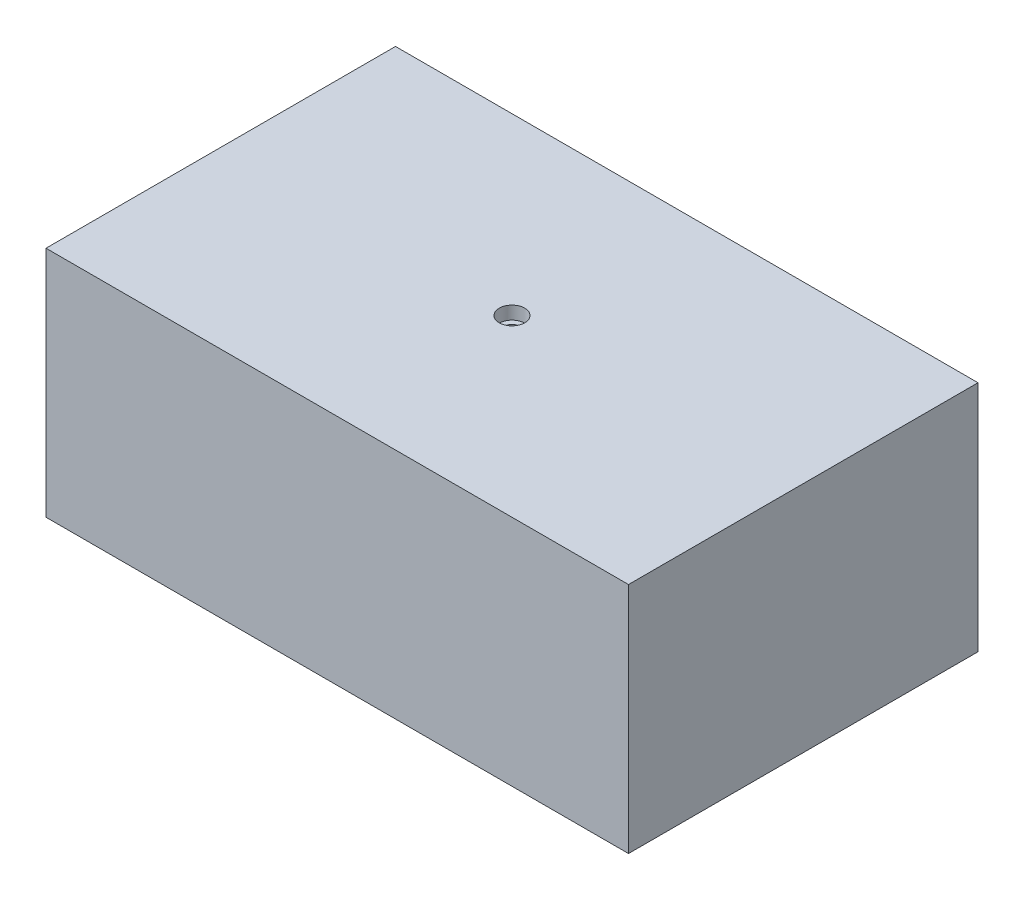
ISO-10303-21;
HEADER;
FILE_DESCRIPTION(('STEP AP214'),'2;1');
FILE_NAME('part.step','',(''),(''),'','','');
FILE_SCHEMA(('AUTOMOTIVE_DESIGN { 1 0 10303 214 1 1 1 1 }'));
ENDSEC;
DATA;
#1=APPLICATION_CONTEXT('core data for automotive mechanical design processes');
#2=APPLICATION_PROTOCOL_DEFINITION('international standard','automotive_design',2000,#1);
#3=PRODUCT_CONTEXT('',#1,'mechanical');
#4=PRODUCT('Part','Part','',(#3));
#5=PRODUCT_RELATED_PRODUCT_CATEGORY('part','',(#4));
#6=PRODUCT_DEFINITION_FORMATION('','',#4);
#7=PRODUCT_DEFINITION_CONTEXT('part definition',#1,'design');
#8=PRODUCT_DEFINITION('design','',#6,#7);
#9=PRODUCT_DEFINITION_SHAPE('','',#8);
#10=(LENGTH_UNIT() NAMED_UNIT(*) SI_UNIT(.MILLI.,.METRE.));
#11=(NAMED_UNIT(*) PLANE_ANGLE_UNIT() SI_UNIT($,.RADIAN.));
#12=(NAMED_UNIT(*) SI_UNIT($,.STERADIAN.) SOLID_ANGLE_UNIT());
#13=UNCERTAINTY_MEASURE_WITH_UNIT(LENGTH_MEASURE(1.E-05),#10,'distance_accuracy_value','');
#14=(GEOMETRIC_REPRESENTATION_CONTEXT(3) GLOBAL_UNCERTAINTY_ASSIGNED_CONTEXT((#13)) GLOBAL_UNIT_ASSIGNED_CONTEXT((#10,
#11,#12)) REPRESENTATION_CONTEXT('',''));
#15=CARTESIAN_POINT('',(0.,0.,0.));
#16=DIRECTION('',(0.,0.,1.));
#17=DIRECTION('',(1.,0.,0.));
#18=AXIS2_PLACEMENT_3D('',#15,#16,#17);
#19=CARTESIAN_POINT('',(63.5000000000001,50.8,38.1000000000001));
#20=DIRECTION('',(-1.,0.,0.));
#21=DIRECTION('',(0.,0.,1.));
#22=AXIS2_PLACEMENT_3D('',#19,#20,#21);
#23=PLANE('',#22);
#24=DIRECTION('',(0.,0.,-1.));
#25=VECTOR('',#24,1.);
#26=CARTESIAN_POINT('',(63.5000000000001,0.,38.1000000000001));
#27=LINE('',#26,#25);
#28=CARTESIAN_POINT('',(63.5000000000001,0.,38.1000000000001));
#29=VERTEX_POINT('',#28);
#30=CARTESIAN_POINT('',(63.5000000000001,0.,-38.0999999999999));
#31=VERTEX_POINT('',#30);
#32=EDGE_CURVE('E100',#29,#31,#27,.T.);
#33=ORIENTED_EDGE('',*,*,#32,.T.);
#34=DIRECTION('',(0.,-1.,0.));
#35=VECTOR('',#34,1.);
#36=CARTESIAN_POINT('',(63.5000000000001,50.8,-38.0999999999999));
#37=LINE('',#36,#35);
#38=CARTESIAN_POINT('',(63.5000000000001,50.8,-38.0999999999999));
#39=VERTEX_POINT('',#38);
#40=EDGE_CURVE('E11',#39,#31,#37,.T.);
#41=ORIENTED_EDGE('',*,*,#40,.F.);
#42=DIRECTION('',(0.,0.,-1.));
#43=VECTOR('',#42,1.);
#44=CARTESIAN_POINT('',(63.5000000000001,50.8,38.1000000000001));
#45=LINE('',#44,#43);
#46=CARTESIAN_POINT('',(63.5000000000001,50.8,38.1000000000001));
#47=VERTEX_POINT('',#46);
#48=EDGE_CURVE('E88',#47,#39,#45,.T.);
#49=ORIENTED_EDGE('',*,*,#48,.F.);
#50=DIRECTION('',(0.,-1.,0.));
#51=VECTOR('',#50,1.);
#52=CARTESIAN_POINT('',(63.5000000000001,50.8,38.1000000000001));
#53=LINE('',#52,#51);
#54=EDGE_CURVE('E96',#47,#29,#53,.T.);
#55=ORIENTED_EDGE('',*,*,#54,.T.);
#56=EDGE_LOOP('',(#33,#41,#49,#55));
#57=FACE_BOUND('',#56,.T.);
#58=ADVANCED_FACE('F37',(#57),#23,.F.);
#59=CARTESIAN_POINT('',(-63.4999999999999,50.8,-38.0999999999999));
#60=DIRECTION('',(0.,0.,1.));
#61=DIRECTION('',(1.,0.,0.));
#62=AXIS2_PLACEMENT_3D('',#59,#60,#61);
#63=PLANE('',#62);
#64=DIRECTION('',(-1.,0.,0.));
#65=VECTOR('',#64,1.);
#66=CARTESIAN_POINT('',(-63.4999999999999,0.,-38.0999999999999));
#67=LINE('',#66,#65);
#68=CARTESIAN_POINT('',(-63.4999999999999,0.,-38.0999999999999));
#69=VERTEX_POINT('',#68);
#70=EDGE_CURVE('E92',#31,#69,#67,.T.);
#71=ORIENTED_EDGE('',*,*,#70,.T.);
#72=DIRECTION('',(0.,-1.,0.));
#73=VECTOR('',#72,1.);
#74=CARTESIAN_POINT('',(-63.4999999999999,50.8,-38.0999999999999));
#75=LINE('',#74,#73);
#76=CARTESIAN_POINT('',(-63.4999999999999,50.8,-38.0999999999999));
#77=VERTEX_POINT('',#76);
#78=EDGE_CURVE('E45',#77,#69,#75,.T.);
#79=ORIENTED_EDGE('',*,*,#78,.F.);
#80=DIRECTION('',(-1.,0.,0.));
#81=VECTOR('',#80,1.);
#82=CARTESIAN_POINT('',(-63.4999999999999,50.8,-38.0999999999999));
#83=LINE('',#82,#81);
#84=EDGE_CURVE('E83',#39,#77,#83,.T.);
#85=ORIENTED_EDGE('',*,*,#84,.F.);
#86=ORIENTED_EDGE('',*,*,#40,.T.);
#87=EDGE_LOOP('',(#71,#79,#85,#86));
#88=FACE_BOUND('',#87,.T.);
#89=ADVANCED_FACE('F91',(#88),#63,.F.);
#90=CARTESIAN_POINT('',(-63.4999999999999,50.8,38.1000000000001));
#91=DIRECTION('',(1.,0.,0.));
#92=DIRECTION('',(0.,0.,-1.));
#93=AXIS2_PLACEMENT_3D('',#90,#91,#92);
#94=PLANE('',#93);
#95=DIRECTION('',(0.,0.,1.));
#96=VECTOR('',#95,1.);
#97=CARTESIAN_POINT('',(-63.4999999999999,0.,38.1000000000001));
#98=LINE('',#97,#96);
#99=CARTESIAN_POINT('',(-63.4999999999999,0.,38.1000000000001));
#100=VERTEX_POINT('',#99);
#101=EDGE_CURVE('E70',#69,#100,#98,.T.);
#102=ORIENTED_EDGE('',*,*,#101,.T.);
#103=DIRECTION('',(0.,-1.,0.));
#104=VECTOR('',#103,1.);
#105=CARTESIAN_POINT('',(-63.4999999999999,50.8,38.1000000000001));
#106=LINE('',#105,#104);
#107=CARTESIAN_POINT('',(-63.4999999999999,50.8,38.1000000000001));
#108=VERTEX_POINT('',#107);
#109=EDGE_CURVE('E93',#108,#100,#106,.T.);
#110=ORIENTED_EDGE('',*,*,#109,.F.);
#111=DIRECTION('',(0.,0.,1.));
#112=VECTOR('',#111,1.);
#113=CARTESIAN_POINT('',(-63.4999999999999,50.8,38.1000000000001));
#114=LINE('',#113,#112);
#115=EDGE_CURVE('E86',#77,#108,#114,.T.);
#116=ORIENTED_EDGE('',*,*,#115,.F.);
#117=ORIENTED_EDGE('',*,*,#78,.T.);
#118=EDGE_LOOP('',(#102,#110,#116,#117));
#119=FACE_BOUND('',#118,.T.);
#120=ADVANCED_FACE('F94',(#119),#94,.F.);
#121=CARTESIAN_POINT('',(-63.4999999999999,50.8,38.1000000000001));
#122=DIRECTION('',(0.,0.,-1.));
#123=DIRECTION('',(-1.,0.,0.));
#124=AXIS2_PLACEMENT_3D('',#121,#122,#123);
#125=PLANE('',#124);
#126=DIRECTION('',(1.,0.,0.));
#127=VECTOR('',#126,1.);
#128=CARTESIAN_POINT('',(-63.4999999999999,0.,38.1000000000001));
#129=LINE('',#128,#127);
#130=EDGE_CURVE('E76',#100,#29,#129,.T.);
#131=ORIENTED_EDGE('',*,*,#130,.T.);
#132=ORIENTED_EDGE('',*,*,#54,.F.);
#133=DIRECTION('',(1.,0.,0.));
#134=VECTOR('',#133,1.);
#135=CARTESIAN_POINT('',(-63.4999999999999,50.8,38.1000000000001));
#136=LINE('',#135,#134);
#137=EDGE_CURVE('E53',#108,#47,#136,.T.);
#138=ORIENTED_EDGE('',*,*,#137,.F.);
#139=ORIENTED_EDGE('',*,*,#109,.T.);
#140=EDGE_LOOP('',(#131,#132,#138,#139));
#141=FACE_BOUND('',#140,.T.);
#142=ADVANCED_FACE('F108',(#141),#125,.F.);
#143=CARTESIAN_POINT('',(0.,50.8,0.));
#144=DIRECTION('',(0.,-1.,0.));
#145=DIRECTION('',(0.,0.,-1.));
#146=AXIS2_PLACEMENT_3D('',#143,#144,#145);
#147=PLANE('',#146);
#148=CARTESIAN_POINT('',(0.,50.8,0.));
#149=DIRECTION('',(0.,1.,0.));
#150=DIRECTION('',(0.,0.,1.));
#151=AXIS2_PLACEMENT_3D('',#148,#149,#150);
#152=CIRCLE('',#151,2.77876);
#153=CARTESIAN_POINT('',(0.,50.8,2.77876));
#154=VERTEX_POINT('',#153);
#155=EDGE_CURVE('E122',#154,#154,#152,.T.);
#156=ORIENTED_EDGE('',*,*,#155,.F.);
#157=EDGE_LOOP('',(#156));
#158=FACE_BOUND('',#157,.T.);
#159=ORIENTED_EDGE('',*,*,#48,.T.);
#160=ORIENTED_EDGE('',*,*,#84,.T.);
#161=ORIENTED_EDGE('',*,*,#115,.T.);
#162=ORIENTED_EDGE('',*,*,#137,.T.);
#163=EDGE_LOOP('',(#159,#160,#161,#162));
#164=FACE_BOUND('',#163,.T.);
#165=ADVANCED_FACE('F84',(#158,#164),#147,.F.);
#166=CARTESIAN_POINT('',(0.,0.,0.));
#167=DIRECTION('',(0.,-1.,0.));
#168=DIRECTION('',(0.,0.,-1.));
#169=AXIS2_PLACEMENT_3D('',#166,#167,#168);
#170=PLANE('',#169);
#171=CARTESIAN_POINT('',(0.,0.,0.));
#172=DIRECTION('',(0.,1.,0.));
#173=DIRECTION('',(0.,0.,1.));
#174=AXIS2_PLACEMENT_3D('',#171,#172,#173);
#175=CIRCLE('',#174,1.63194999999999);
#176=CARTESIAN_POINT('',(0.,0.,1.63194999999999));
#177=VERTEX_POINT('',#176);
#178=EDGE_CURVE('E103',#177,#177,#175,.T.);
#179=ORIENTED_EDGE('',*,*,#178,.T.);
#180=EDGE_LOOP('',(#179));
#181=FACE_BOUND('',#180,.T.);
#182=ORIENTED_EDGE('',*,*,#32,.F.);
#183=ORIENTED_EDGE('',*,*,#130,.F.);
#184=ORIENTED_EDGE('',*,*,#101,.F.);
#185=ORIENTED_EDGE('',*,*,#70,.F.);
#186=EDGE_LOOP('',(#182,#183,#184,#185));
#187=FACE_BOUND('',#186,.T.);
#188=ADVANCED_FACE('F111',(#181,#187),#170,.T.);
#189=CARTESIAN_POINT('',(0.,50.8,0.));
#190=DIRECTION('',(0.,1.,0.));
#191=DIRECTION('',(0.,0.,1.));
#192=AXIS2_PLACEMENT_3D('',#189,#190,#191);
#193=CYLINDRICAL_SURFACE('',#192,1.63195);
#194=ORIENTED_EDGE('',*,*,#178,.F.);
#195=EDGE_LOOP('',(#194));
#196=FACE_BOUND('',#195,.T.);
#197=CARTESIAN_POINT('',(0.,47.9552,0.));
#198=DIRECTION('',(0.,1.,0.));
#199=DIRECTION('',(0.,0.,1.));
#200=AXIS2_PLACEMENT_3D('',#197,#198,#199);
#201=CIRCLE('',#200,1.63195000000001);
#202=CARTESIAN_POINT('',(0.,47.9552,1.63195000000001));
#203=VERTEX_POINT('',#202);
#204=EDGE_CURVE('E116',#203,#203,#201,.T.);
#205=ORIENTED_EDGE('',*,*,#204,.T.);
#206=EDGE_LOOP('',(#205));
#207=FACE_BOUND('',#206,.T.);
#208=ADVANCED_FACE('F134',(#196,#207),#193,.F.);
#209=CARTESIAN_POINT('',(1.63195000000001,47.9552,0.));
#210=DIRECTION('',(0.,-1.,0.));
#211=DIRECTION('',(0.,0.,-1.));
#212=AXIS2_PLACEMENT_3D('',#209,#210,#211);
#213=PLANE('',#212);
#214=ORIENTED_EDGE('',*,*,#204,.F.);
#215=EDGE_LOOP('',(#214));
#216=FACE_BOUND('',#215,.T.);
#217=CARTESIAN_POINT('',(0.,47.9552,0.));
#218=DIRECTION('',(0.,1.,0.));
#219=DIRECTION('',(0.,0.,1.));
#220=AXIS2_PLACEMENT_3D('',#217,#218,#219);
#221=CIRCLE('',#220,2.77876);
#222=CARTESIAN_POINT('',(0.,47.9552,2.77876));
#223=VERTEX_POINT('',#222);
#224=EDGE_CURVE('E119',#223,#223,#221,.T.);
#225=ORIENTED_EDGE('',*,*,#224,.T.);
#226=EDGE_LOOP('',(#225));
#227=FACE_BOUND('',#226,.T.);
#228=ADVANCED_FACE('F175',(#216,#227),#213,.F.);
#229=CARTESIAN_POINT('',(0.,50.8,0.));
#230=DIRECTION('',(0.,1.,0.));
#231=DIRECTION('',(0.,0.,1.));
#232=AXIS2_PLACEMENT_3D('',#229,#230,#231);
#233=CYLINDRICAL_SURFACE('',#232,2.77876);
#234=ORIENTED_EDGE('',*,*,#224,.F.);
#235=EDGE_LOOP('',(#234));
#236=FACE_BOUND('',#235,.T.);
#237=ORIENTED_EDGE('',*,*,#155,.T.);
#238=EDGE_LOOP('',(#237));
#239=FACE_BOUND('',#238,.T.);
#240=ADVANCED_FACE('F126',(#236,#239),#233,.F.);
#241=CLOSED_SHELL('',(#58,#89,#120,#142,#165,#188,#208,#228,#240));
#242=MANIFOLD_SOLID_BREP('B2',#241);
#243=ADVANCED_BREP_SHAPE_REPRESENTATION('',(#18,#242),#14);
#244=SHAPE_DEFINITION_REPRESENTATION(#9,#243);
ENDSEC;
END-ISO-10303-21;
